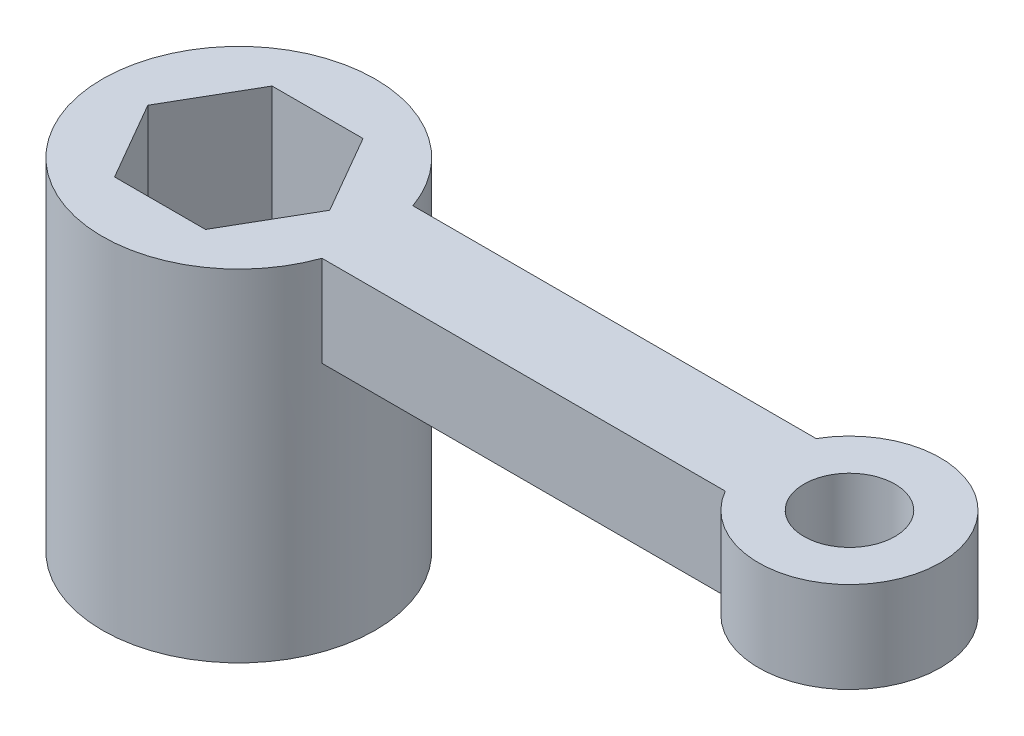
from build123d import *

# Parameters (mm, degrees)
SKETCH2_R           = 0.5
BOSS_EXTRUDE1_DEPTH = 1
BOSS_EXTRUDE2_START = 2.75
SKETCH3_R           = 1.5
BOSS_EXTRUDE2_DEPTH = 2.75


with BuildPart() as part:
    # Sketch2 → Boss-Extrude1 (new body)
    with BuildSketch(Plane(origin=(0, 0, 0), x_dir=(1, 0, 0), z_dir=(0, 1, 0))):
        with BuildLine():
            Line((1.414213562, -0.5), (5.848323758, -0.5))
            ThreePointArc((5.848323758, -0.5), (7.714349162, 0), (5.848323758, 0.5))
            Line((5.848323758, 0.5), (1.414213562, 0.5))
            ThreePointArc((1.414213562, 0.5), (-1.5, 0), (1.414213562, -0.5))
        make_face()
        with Locations(Location((6.714349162, 0, 0), (0, 0, 270))):
            Circle(SKETCH2_R, mode=Mode.SUBTRACT)
        Polygon((0.5, -0.866025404), (1, 0), (0.5, 0.866025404), (-0.5, 0.866025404), (-1, 0), (-0.5, -0.866025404), align=None, mode=Mode.SUBTRACT)
    extrude(amount=BOSS_EXTRUDE1_DEPTH)

    # Sketch3 → Boss-Extrude2 (add)
    with BuildSketch(Plane.XZ.offset(BOSS_EXTRUDE2_START)):
        with Locations(Location((0, 0, 0), (0, 0, 270))):
            Circle(SKETCH3_R)
        Polygon((1, 0), (0.5, -0.866025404), (-0.5, -0.866025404), (-1, 0), (-0.5, 0.866025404), (0.5, 0.866025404), align=None, mode=Mode.SUBTRACT)
    extrude(amount=-BOSS_EXTRUDE2_DEPTH)


solid = part.part
